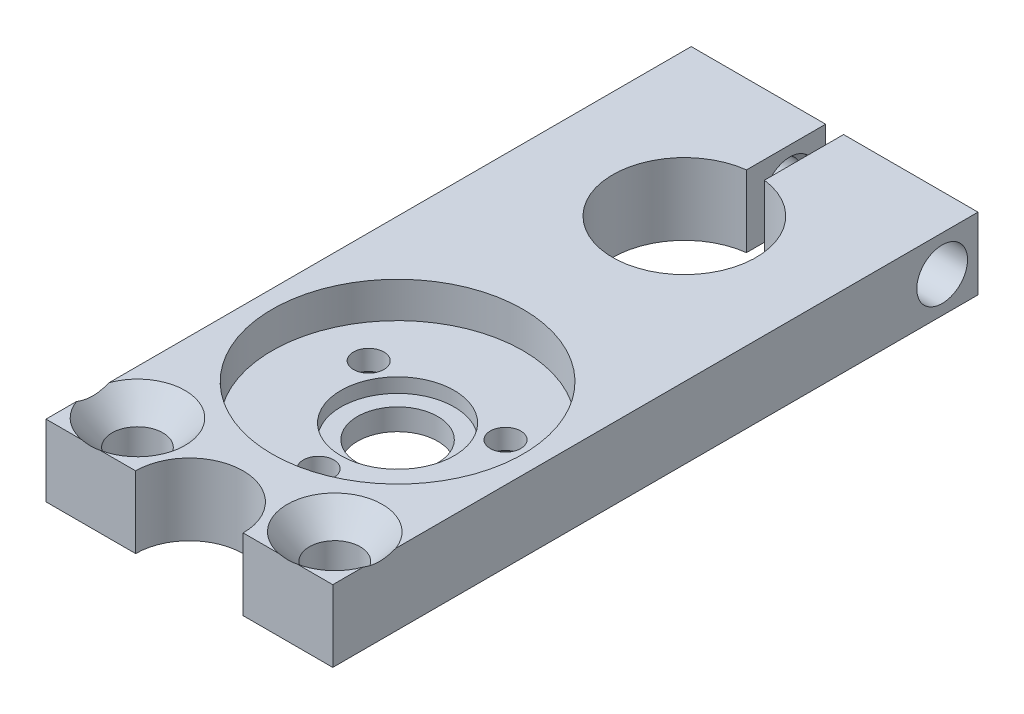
from build123d import *

# Parameters (mm, degrees)
SKETCH1_W                                         = 57.15
SKETCH1_H                                         = 6.35
EXTRUDE1_DEPTH                                    = 12.7
SKETCH2_R                                         = 11.1125
CUT_EXTRUDE1_DEPTH                                = 3.175
SKETCH3_R                                         = 5.0165
CUT_EXTRUDE2_DEPTH                                = 1.27
CUT_EXTRUDE3_REACH                                = 60.713
SKETCH4_R                                         = 3.556
CUT_EXTRUDE4_REACH                                = 60.887
SKETCH5_R                                         = 1.016
CSK_FOR_M2_5_FLAT_HEAD_MACHINE_SCREW1_D           = 2.7
CSK_FOR_M2_5_FLAT_HEAD_MACHINE_SCREW1_CSINK_D     = 5.5
CSK_FOR_M2_5_FLAT_HEAD_MACHINE_SCREW1_CSINK_ANGLE = 90
CUT_EXTRUDE5_REACH                                = 60.887
CUT_EXTRUDE6_REACH                                = 60.887
SKETCH12_R                                        = 4.7625
SKETCH15_W                                        = 1.7272
SKETCH15_H                                        = 11.90625
F_8_CLEARANCE_HOLE1_D                             = 4.4958
F_8_CLEARANCE_HOLE1_DEPTH                         = 13.97
F_8_CLEARANCE_HOLE1_TIP                           = 1.350674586
CSK_FOR_8_FLAT_HEAD_MACHINE_SCREW1_D              = 4.4958
CSK_FOR_8_FLAT_HEAD_MACHINE_SCREW1_CSINK_D        = 8.4328
CSK_FOR_8_FLAT_HEAD_MACHINE_SCREW1_CSINK_ANGLE    = 82


with BuildPart() as part:
    # Sketch1 → Extrude1 (new, symmetric)
    with BuildSketch(Plane(origin=(0, 0, 0), x_dir=(0, 0, -1), z_dir=(1, 0, 0))):
        with Locations((28.575, 0)):
            Rectangle(SKETCH1_W, SKETCH1_H)
    extrude(amount=EXTRUDE1_DEPTH, both=True)

    # Sketch2 → Cut-Extrude1 (cut)
    with BuildSketch(Plane(origin=(0, 3.175, 0), x_dir=(1, 0, 0), z_dir=(0, 1, 0))):
        with Locations(Location((0, 18.4404, 0), (0, 0, 270))):
            Circle(SKETCH2_R)
    extrude(amount=-CUT_EXTRUDE1_DEPTH, mode=Mode.SUBTRACT)

    # Sketch3 → Cut-Extrude2 (cut)
    with BuildSketch(Plane(origin=(0, 0, 0), x_dir=(1, 0, 0), z_dir=(0, 1, 0))):
        with Locations(Location((0, 18.4404, 0), (0, 0, 270))):
            Circle(SKETCH3_R)
    extrude(amount=-CUT_EXTRUDE2_DEPTH, mode=Mode.SUBTRACT)

    # Sketch4 → Cut-Extrude3 (cut, up to next)
    with BuildSketch(Plane(origin=(0, -1.27, 0), x_dir=(1, 0, 0), z_dir=(0, 1, 0)), mode=Mode.PRIVATE) as cut_extrude3_sk1:
        with Locations(Location((0, 18.4404, 0), (0, 0, 270))):
            Circle(SKETCH4_R)
    cut_extrude3_tool1 = extrude(cut_extrude3_sk1.sketch, amount=-CUT_EXTRUDE3_REACH, mode=Mode.PRIVATE) & part.part
    add(cut_extrude3_tool1.solids().sort_by_distance((0, -1.27, -18.4404))[0], mode=Mode.SUBTRACT)

    # Sketch5 → Cut-Extrude4 (cut, up to next)
    with BuildSketch(Plane.XZ.offset(3.175), mode=Mode.PRIVATE) as cut_extrude4_sk1:
        with Locations(Location((0, -11.4427, 0), (0, 0, 270))):
            Circle(SKETCH5_R)
    cut_extrude4_tool1 = extrude(cut_extrude4_sk1.sketch, amount=-CUT_EXTRUDE4_REACH, mode=Mode.PRIVATE) & part.part
    # Sketch5 → Cut-Extrude4 (cut, up to next)
    with BuildSketch(Plane.XZ.offset(3.175), mode=Mode.PRIVATE) as cut_extrude4_sk2:
        with Locations(Location((6.060185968, -21.93925, 0), (0, 0, 270))):
            Circle(SKETCH5_R)
    cut_extrude4_tool2 = extrude(cut_extrude4_sk2.sketch, amount=-CUT_EXTRUDE4_REACH, mode=Mode.PRIVATE) & part.part
    # Sketch5 → Cut-Extrude4 (cut, up to next)
    with BuildSketch(Plane.XZ.offset(3.175), mode=Mode.PRIVATE) as cut_extrude4_sk3:
        with Locations(Location((-6.060185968, -21.93925, 0), (0, 0, 270))):
            Circle(SKETCH5_R)
    cut_extrude4_tool3 = extrude(cut_extrude4_sk3.sketch, amount=-CUT_EXTRUDE4_REACH, mode=Mode.PRIVATE) & part.part
    add(cut_extrude4_tool1.solids().sort_by_distance((0, -3.175, -11.4427))[0], mode=Mode.SUBTRACT)
    add(cut_extrude4_tool2.solids().sort_by_distance((6.060186, -3.175, -21.93925))[0], mode=Mode.SUBTRACT)
    add(cut_extrude4_tool3.solids().sort_by_distance((-6.060186, -3.175, -21.93925))[0], mode=Mode.SUBTRACT)

    # CSK for M2.5 Flat Head Machine Screw1 (through all)
    with Locations(Plane(origin=(6.060185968, -3.175, -21.93925), x_dir=(0, 0, -1), z_dir=(0, -1, 0))):
        with Locations((0, 0), (0, -12.120371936), (-10.49655, -6.060185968)):
            CounterSinkHole(CSK_FOR_M2_5_FLAT_HEAD_MACHINE_SCREW1_D / 2, CSK_FOR_M2_5_FLAT_HEAD_MACHINE_SCREW1_CSINK_D / 2, counter_sink_angle=CSK_FOR_M2_5_FLAT_HEAD_MACHINE_SCREW1_CSINK_ANGLE)

    # Sketch7 → Cut-Extrude5 (cut, up to next)
    with BuildSketch(Plane(origin=(0, 3.175, 0), x_dir=(1, 0, 0), z_dir=(0, 1, 0)), mode=Mode.PRIVATE) as cut_extrude5_sk1:
        with BuildLine():
            Line((-0.79375, 57.15), (0.79375, 57.15))
            Line((0.79375, 57.15), (0.79375, 50.140595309))
            ThreePointArc((0.79375, 50.140595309), (0, 37.4904), (-0.79375, 50.140595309))
            Line((-0.79375, 50.140595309), (-0.79375, 57.15))
        make_face()
    cut_extrude5_tool1 = extrude(cut_extrude5_sk1.sketch, amount=-CUT_EXTRUDE5_REACH, mode=Mode.PRIVATE) & part.part
    add(cut_extrude5_tool1.solids().sort_by_distance((0, 3.175, -44.630009))[0], mode=Mode.SUBTRACT)

    # Sketch12 → Cut-Extrude6 (cut, up to next)
    with BuildSketch(Plane(origin=(0, 3.175, 0), x_dir=(1, 0, 0), z_dir=(0, 1, 0)), mode=Mode.PRIVATE) as cut_extrude6_sk1:
        Circle(SKETCH12_R)
    cut_extrude6_tool1 = extrude(cut_extrude6_sk1.sketch, amount=-CUT_EXTRUDE6_REACH, mode=Mode.PRIVATE) & part.part
    add(cut_extrude6_tool1.solids().sort_by_distance((0, 3.175, 0))[0], mode=Mode.SUBTRACT)

    # Sketch15 → 8-32 Tapped Hole3 (revolve, cut)
    with BuildSketch(Plane(origin=(-0.79375, 0, -53.975), x_dir=(0, 0, -1), z_dir=(0, 1, 0))):
        with Locations((0.8636, 5.953125)):
            Rectangle(SKETCH15_W, SKETCH15_H)
    revolve(axis=Axis((5.55625, 0, -53.975), (-1, 0, 0)), mode=Mode.SUBTRACT)

    # 8 Clearance Hole1
    with Locations(Plane(origin=(12.7, 0, -53.975), x_dir=(0, 0, 1), z_dir=(1, 0, 0))):
        with Locations((0, 0)):
            Hole(F_8_CLEARANCE_HOLE1_D / 2, depth=F_8_CLEARANCE_HOLE1_DEPTH)
            with Locations((0, 0, -(F_8_CLEARANCE_HOLE1_DEPTH + F_8_CLEARANCE_HOLE1_TIP / 2))):  # 118° drill point
                Cone(0, F_8_CLEARANCE_HOLE1_D / 2, F_8_CLEARANCE_HOLE1_TIP, mode=Mode.SUBTRACT)

    # CSK for _8 Flat Head Machine Screw1 (through all)
    with Locations(Plane(origin=(-8.7376, 3.175, -4.1402), x_dir=(0, 0, 1), z_dir=(0, 1, 0))):
        with Locations((0, 0), (0, 17.4752)):
            CounterSinkHole(CSK_FOR_8_FLAT_HEAD_MACHINE_SCREW1_D / 2, CSK_FOR_8_FLAT_HEAD_MACHINE_SCREW1_CSINK_D / 2, counter_sink_angle=CSK_FOR_8_FLAT_HEAD_MACHINE_SCREW1_CSINK_ANGLE)


solid = part.part
